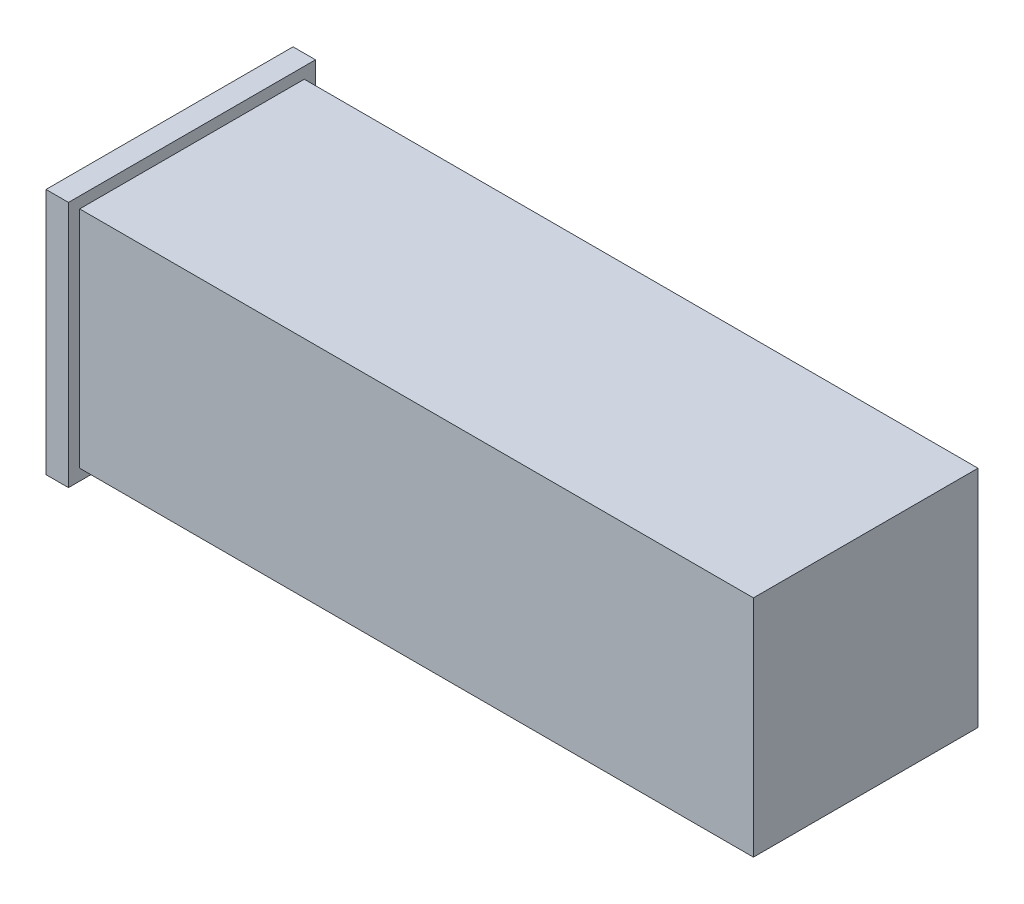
ISO-10303-21;
HEADER;
FILE_DESCRIPTION(('STEP AP214'),'2;1');
FILE_NAME('part.step','',(''),(''),'','','');
FILE_SCHEMA(('AUTOMOTIVE_DESIGN { 1 0 10303 214 1 1 1 1 }'));
ENDSEC;
DATA;
#1=APPLICATION_CONTEXT('core data for automotive mechanical design processes');
#2=APPLICATION_PROTOCOL_DEFINITION('international standard','automotive_design',2000,#1);
#3=PRODUCT_CONTEXT('',#1,'mechanical');
#4=PRODUCT('Part','Part','',(#3));
#5=PRODUCT_RELATED_PRODUCT_CATEGORY('part','',(#4));
#6=PRODUCT_DEFINITION_FORMATION('','',#4);
#7=PRODUCT_DEFINITION_CONTEXT('part definition',#1,'design');
#8=PRODUCT_DEFINITION('design','',#6,#7);
#9=PRODUCT_DEFINITION_SHAPE('','',#8);
#10=(LENGTH_UNIT() NAMED_UNIT(*) SI_UNIT(.MILLI.,.METRE.));
#11=(NAMED_UNIT(*) PLANE_ANGLE_UNIT() SI_UNIT($,.RADIAN.));
#12=(NAMED_UNIT(*) SI_UNIT($,.STERADIAN.) SOLID_ANGLE_UNIT());
#13=UNCERTAINTY_MEASURE_WITH_UNIT(LENGTH_MEASURE(1.E-05),#10,'distance_accuracy_value','');
#14=(GEOMETRIC_REPRESENTATION_CONTEXT(3) GLOBAL_UNCERTAINTY_ASSIGNED_CONTEXT((#13)) GLOBAL_UNIT_ASSIGNED_CONTEXT((#10,
#11,#12)) REPRESENTATION_CONTEXT('',''));
#15=CARTESIAN_POINT('',(0.,0.,0.));
#16=DIRECTION('',(0.,0.,1.));
#17=DIRECTION('',(1.,0.,0.));
#18=AXIS2_PLACEMENT_3D('',#15,#16,#17);
#19=CARTESIAN_POINT('',(0.,-10.9965635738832,100.));
#20=DIRECTION('',(0.,1.,0.));
#21=DIRECTION('',(-1.,0.,0.));
#22=AXIS2_PLACEMENT_3D('',#19,#20,#21);
#23=PLANE('',#22);
#24=DIRECTION('',(1.,0.,0.));
#25=VECTOR('',#24,1.);
#26=CARTESIAN_POINT('',(0.,-10.9965635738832,0.));
#27=LINE('',#26,#25);
#28=CARTESIAN_POINT('',(0.,-10.9965635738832,0.));
#29=VERTEX_POINT('',#28);
#30=CARTESIAN_POINT('',(300.,-10.9965635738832,0.));
#31=VERTEX_POINT('',#30);
#32=EDGE_CURVE('E68',#29,#31,#27,.T.);
#33=ORIENTED_EDGE('',*,*,#32,.T.);
#34=DIRECTION('',(0.,0.,-1.));
#35=VECTOR('',#34,1.);
#36=CARTESIAN_POINT('',(300.,-10.9965635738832,100.));
#37=LINE('',#36,#35);
#38=CARTESIAN_POINT('',(300.,-10.9965635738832,100.));
#39=VERTEX_POINT('',#38);
#40=EDGE_CURVE('E47',#39,#31,#37,.T.);
#41=ORIENTED_EDGE('',*,*,#40,.F.);
#42=DIRECTION('',(1.,0.,0.));
#43=VECTOR('',#42,1.);
#44=CARTESIAN_POINT('',(0.,-10.9965635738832,100.));
#45=LINE('',#44,#43);
#46=CARTESIAN_POINT('',(0.,-10.9965635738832,100.));
#47=VERTEX_POINT('',#46);
#48=EDGE_CURVE('E80',#47,#39,#45,.T.);
#49=ORIENTED_EDGE('',*,*,#48,.F.);
#50=DIRECTION('',(0.,0.,-1.));
#51=VECTOR('',#50,1.);
#52=CARTESIAN_POINT('',(0.,-10.9965635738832,100.));
#53=LINE('',#52,#51);
#54=EDGE_CURVE('E11',#47,#29,#53,.T.);
#55=ORIENTED_EDGE('',*,*,#54,.T.);
#56=EDGE_LOOP('',(#33,#41,#49,#55));
#57=FACE_BOUND('',#56,.T.);
#58=ADVANCED_FACE('F39',(#57),#23,.F.);
#59=CARTESIAN_POINT('',(300.,-10.9965635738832,100.));
#60=DIRECTION('',(-1.,0.,0.));
#61=DIRECTION('',(0.,0.,1.));
#62=AXIS2_PLACEMENT_3D('',#59,#60,#61);
#63=PLANE('',#62);
#64=DIRECTION('',(0.,1.,0.));
#65=VECTOR('',#64,1.);
#66=CARTESIAN_POINT('',(300.,-10.9965635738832,0.));
#67=LINE('',#66,#65);
#68=CARTESIAN_POINT('',(300.,89.0034364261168,0.));
#69=VERTEX_POINT('',#68);
#70=EDGE_CURVE('E75',#31,#69,#67,.T.);
#71=ORIENTED_EDGE('',*,*,#70,.T.);
#72=DIRECTION('',(0.,0.,-1.));
#73=VECTOR('',#72,1.);
#74=CARTESIAN_POINT('',(300.,89.0034364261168,100.));
#75=LINE('',#74,#73);
#76=CARTESIAN_POINT('',(300.,89.0034364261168,100.));
#77=VERTEX_POINT('',#76);
#78=EDGE_CURVE('E157',#77,#69,#75,.T.);
#79=ORIENTED_EDGE('',*,*,#78,.F.);
#80=DIRECTION('',(0.,1.,0.));
#81=VECTOR('',#80,1.);
#82=CARTESIAN_POINT('',(300.,-10.9965635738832,100.));
#83=LINE('',#82,#81);
#84=EDGE_CURVE('E147',#39,#77,#83,.T.);
#85=ORIENTED_EDGE('',*,*,#84,.F.);
#86=ORIENTED_EDGE('',*,*,#40,.T.);
#87=EDGE_LOOP('',(#71,#79,#85,#86));
#88=FACE_BOUND('',#87,.T.);
#89=ADVANCED_FACE('F159',(#88),#63,.F.);
#90=CARTESIAN_POINT('',(0.,89.0034364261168,100.));
#91=DIRECTION('',(0.,-1.,0.));
#92=DIRECTION('',(0.,0.,-1.));
#93=AXIS2_PLACEMENT_3D('',#90,#91,#92);
#94=PLANE('',#93);
#95=DIRECTION('',(-1.,0.,0.));
#96=VECTOR('',#95,1.);
#97=CARTESIAN_POINT('',(0.,89.0034364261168,0.));
#98=LINE('',#97,#96);
#99=CARTESIAN_POINT('',(0.,89.0034364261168,0.));
#100=VERTEX_POINT('',#99);
#101=EDGE_CURVE('E145',#69,#100,#98,.T.);
#102=ORIENTED_EDGE('',*,*,#101,.T.);
#103=DIRECTION('',(0.,0.,-1.));
#104=VECTOR('',#103,1.);
#105=CARTESIAN_POINT('',(0.,89.0034364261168,100.));
#106=LINE('',#105,#104);
#107=CARTESIAN_POINT('',(0.,89.0034364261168,100.));
#108=VERTEX_POINT('',#107);
#109=EDGE_CURVE('E149',#108,#100,#106,.T.);
#110=ORIENTED_EDGE('',*,*,#109,.F.);
#111=DIRECTION('',(-1.,0.,0.));
#112=VECTOR('',#111,1.);
#113=CARTESIAN_POINT('',(0.,89.0034364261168,100.));
#114=LINE('',#113,#112);
#115=EDGE_CURVE('E55',#77,#108,#114,.T.);
#116=ORIENTED_EDGE('',*,*,#115,.F.);
#117=ORIENTED_EDGE('',*,*,#78,.T.);
#118=EDGE_LOOP('',(#102,#110,#116,#117));
#119=FACE_BOUND('',#118,.T.);
#120=ADVANCED_FACE('F164',(#119),#94,.F.);
#121=CARTESIAN_POINT('',(0.,0.,100.));
#122=DIRECTION('',(0.,0.,-1.));
#123=DIRECTION('',(-1.,0.,0.));
#124=AXIS2_PLACEMENT_3D('',#121,#122,#123);
#125=PLANE('',#124);
#126=DIRECTION('',(0.,-1.,0.));
#127=VECTOR('',#126,1.);
#128=CARTESIAN_POINT('',(0.,-10.9965635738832,100.));
#129=LINE('',#128,#127);
#130=EDGE_CURVE('E143',#108,#47,#129,.T.);
#131=ORIENTED_EDGE('',*,*,#130,.T.);
#132=ORIENTED_EDGE('',*,*,#48,.T.);
#133=ORIENTED_EDGE('',*,*,#84,.T.);
#134=ORIENTED_EDGE('',*,*,#115,.T.);
#135=EDGE_LOOP('',(#131,#132,#133,#134));
#136=FACE_BOUND('',#135,.T.);
#137=ADVANCED_FACE('F170',(#136),#125,.F.);
#138=CARTESIAN_POINT('',(0.,0.,0.));
#139=DIRECTION('',(0.,0.,-1.));
#140=DIRECTION('',(-1.,0.,0.));
#141=AXIS2_PLACEMENT_3D('',#138,#139,#140);
#142=PLANE('',#141);
#143=DIRECTION('',(0.,-1.,0.));
#144=VECTOR('',#143,1.);
#145=CARTESIAN_POINT('',(0.,-10.9965635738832,0.));
#146=LINE('',#145,#144);
#147=EDGE_CURVE('E135',#100,#29,#146,.T.);
#148=ORIENTED_EDGE('',*,*,#147,.F.);
#149=ORIENTED_EDGE('',*,*,#101,.F.);
#150=ORIENTED_EDGE('',*,*,#70,.F.);
#151=ORIENTED_EDGE('',*,*,#32,.F.);
#152=EDGE_LOOP('',(#148,#149,#150,#151));
#153=FACE_BOUND('',#152,.T.);
#154=ADVANCED_FACE('F162',(#153),#142,.T.);
#155=CARTESIAN_POINT('',(-10.,-15.9965635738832,105.));
#156=DIRECTION('',(0.,0.,-1.));
#157=DIRECTION('',(-1.,0.,0.));
#158=AXIS2_PLACEMENT_3D('',#155,#156,#157);
#159=PLANE('',#158);
#160=DIRECTION('',(0.,1.,0.));
#161=VECTOR('',#160,1.);
#162=CARTESIAN_POINT('',(0.,-15.9965635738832,105.));
#163=LINE('',#162,#161);
#164=CARTESIAN_POINT('',(0.,-15.9965635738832,105.));
#165=VERTEX_POINT('',#164);
#166=CARTESIAN_POINT('',(0.,94.0034364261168,105.));
#167=VERTEX_POINT('',#166);
#168=EDGE_CURVE('E134',#165,#167,#163,.T.);
#169=ORIENTED_EDGE('',*,*,#168,.T.);
#170=DIRECTION('',(1.,0.,0.));
#171=VECTOR('',#170,1.);
#172=CARTESIAN_POINT('',(-10.,94.0034364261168,105.));
#173=LINE('',#172,#171);
#174=CARTESIAN_POINT('',(-10.,94.0034364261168,105.));
#175=VERTEX_POINT('',#174);
#176=EDGE_CURVE('E114',#175,#167,#173,.T.);
#177=ORIENTED_EDGE('',*,*,#176,.F.);
#178=DIRECTION('',(0.,1.,0.));
#179=VECTOR('',#178,1.);
#180=CARTESIAN_POINT('',(-10.,-15.9965635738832,105.));
#181=LINE('',#180,#179);
#182=CARTESIAN_POINT('',(-10.,-15.9965635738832,105.));
#183=VERTEX_POINT('',#182);
#184=EDGE_CURVE('E121',#183,#175,#181,.T.);
#185=ORIENTED_EDGE('',*,*,#184,.F.);
#186=DIRECTION('',(1.,0.,0.));
#187=VECTOR('',#186,1.);
#188=CARTESIAN_POINT('',(-10.,-15.9965635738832,105.));
#189=LINE('',#188,#187);
#190=EDGE_CURVE('E262',#183,#165,#189,.T.);
#191=ORIENTED_EDGE('',*,*,#190,.T.);
#192=EDGE_LOOP('',(#169,#177,#185,#191));
#193=FACE_BOUND('',#192,.T.);
#194=ADVANCED_FACE('F132',(#193),#159,.F.);
#195=CARTESIAN_POINT('',(-10.,94.0034364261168,-5.));
#196=DIRECTION('',(0.,-1.,0.));
#197=DIRECTION('',(0.,0.,-1.));
#198=AXIS2_PLACEMENT_3D('',#195,#196,#197);
#199=PLANE('',#198);
#200=DIRECTION('',(0.,0.,-1.));
#201=VECTOR('',#200,1.);
#202=CARTESIAN_POINT('',(0.,94.0034364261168,-5.));
#203=LINE('',#202,#201);
#204=CARTESIAN_POINT('',(0.,94.0034364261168,-5.));
#205=VERTEX_POINT('',#204);
#206=EDGE_CURVE('E268',#167,#205,#203,.T.);
#207=ORIENTED_EDGE('',*,*,#206,.T.);
#208=DIRECTION('',(1.,0.,0.));
#209=VECTOR('',#208,1.);
#210=CARTESIAN_POINT('',(-10.,94.0034364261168,-5.));
#211=LINE('',#210,#209);
#212=CARTESIAN_POINT('',(-10.,94.0034364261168,-5.));
#213=VERTEX_POINT('',#212);
#214=EDGE_CURVE('E117',#213,#205,#211,.T.);
#215=ORIENTED_EDGE('',*,*,#214,.F.);
#216=DIRECTION('',(0.,0.,-1.));
#217=VECTOR('',#216,1.);
#218=CARTESIAN_POINT('',(-10.,94.0034364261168,-5.));
#219=LINE('',#218,#217);
#220=EDGE_CURVE('E110',#175,#213,#219,.T.);
#221=ORIENTED_EDGE('',*,*,#220,.F.);
#222=ORIENTED_EDGE('',*,*,#176,.T.);
#223=EDGE_LOOP('',(#207,#215,#221,#222));
#224=FACE_BOUND('',#223,.T.);
#225=ADVANCED_FACE('F112',(#224),#199,.F.);
#226=CARTESIAN_POINT('',(-10.,-15.9965635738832,-4.99999999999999));
#227=DIRECTION('',(0.,0.,1.));
#228=DIRECTION('',(0.,-1.,0.));
#229=AXIS2_PLACEMENT_3D('',#226,#227,#228);
#230=PLANE('',#229);
#231=DIRECTION('',(0.,-1.,0.));
#232=VECTOR('',#231,1.);
#233=CARTESIAN_POINT('',(0.,-15.9965635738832,-4.99999999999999));
#234=LINE('',#233,#232);
#235=CARTESIAN_POINT('',(0.,-15.9965635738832,-4.99999999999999));
#236=VERTEX_POINT('',#235);
#237=EDGE_CURVE('E265',#205,#236,#234,.T.);
#238=ORIENTED_EDGE('',*,*,#237,.T.);
#239=DIRECTION('',(1.,0.,0.));
#240=VECTOR('',#239,1.);
#241=CARTESIAN_POINT('',(-10.,-15.9965635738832,-4.99999999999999));
#242=LINE('',#241,#240);
#243=CARTESIAN_POINT('',(-10.,-15.9965635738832,-4.99999999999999));
#244=VERTEX_POINT('',#243);
#245=EDGE_CURVE('E139',#244,#236,#242,.T.);
#246=ORIENTED_EDGE('',*,*,#245,.F.);
#247=DIRECTION('',(0.,-1.,0.));
#248=VECTOR('',#247,1.);
#249=CARTESIAN_POINT('',(-10.,-15.9965635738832,-4.99999999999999));
#250=LINE('',#249,#248);
#251=EDGE_CURVE('E120',#213,#244,#250,.T.);
#252=ORIENTED_EDGE('',*,*,#251,.F.);
#253=ORIENTED_EDGE('',*,*,#214,.T.);
#254=EDGE_LOOP('',(#238,#246,#252,#253));
#255=FACE_BOUND('',#254,.T.);
#256=ADVANCED_FACE('F222',(#255),#230,.F.);
#257=CARTESIAN_POINT('',(-10.,-15.9965635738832,-4.99999999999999));
#258=DIRECTION('',(0.,1.,0.));
#259=DIRECTION('',(0.,0.,1.));
#260=AXIS2_PLACEMENT_3D('',#257,#258,#259);
#261=PLANE('',#260);
#262=DIRECTION('',(0.,0.,1.));
#263=VECTOR('',#262,1.);
#264=CARTESIAN_POINT('',(0.,-15.9965635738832,-4.99999999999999));
#265=LINE('',#264,#263);
#266=EDGE_CURVE('E130',#236,#165,#265,.T.);
#267=ORIENTED_EDGE('',*,*,#266,.T.);
#268=ORIENTED_EDGE('',*,*,#190,.F.);
#269=DIRECTION('',(0.,0.,1.));
#270=VECTOR('',#269,1.);
#271=CARTESIAN_POINT('',(-10.,-15.9965635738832,-4.99999999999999));
#272=LINE('',#271,#270);
#273=EDGE_CURVE('E126',#244,#183,#272,.T.);
#274=ORIENTED_EDGE('',*,*,#273,.F.);
#275=ORIENTED_EDGE('',*,*,#245,.T.);
#276=EDGE_LOOP('',(#267,#268,#274,#275));
#277=FACE_BOUND('',#276,.T.);
#278=ADVANCED_FACE('F231',(#277),#261,.F.);
#279=CARTESIAN_POINT('',(-10.,0.,0.));
#280=DIRECTION('',(1.,0.,0.));
#281=DIRECTION('',(0.,0.,-1.));
#282=AXIS2_PLACEMENT_3D('',#279,#280,#281);
#283=PLANE('',#282);
#284=ORIENTED_EDGE('',*,*,#184,.T.);
#285=ORIENTED_EDGE('',*,*,#220,.T.);
#286=ORIENTED_EDGE('',*,*,#251,.T.);
#287=ORIENTED_EDGE('',*,*,#273,.T.);
#288=EDGE_LOOP('',(#284,#285,#286,#287));
#289=FACE_BOUND('',#288,.T.);
#290=ADVANCED_FACE('F124',(#289),#283,.F.);
#291=CARTESIAN_POINT('',(0.,0.,0.));
#292=DIRECTION('',(1.,0.,0.));
#293=DIRECTION('',(0.,0.,-1.));
#294=AXIS2_PLACEMENT_3D('',#291,#292,#293);
#295=PLANE('',#294);
#296=ORIENTED_EDGE('',*,*,#109,.T.);
#297=ORIENTED_EDGE('',*,*,#147,.T.);
#298=ORIENTED_EDGE('',*,*,#54,.F.);
#299=ORIENTED_EDGE('',*,*,#130,.F.);
#300=EDGE_LOOP('',(#296,#297,#298,#299));
#301=FACE_BOUND('',#300,.T.);
#302=ORIENTED_EDGE('',*,*,#168,.F.);
#303=ORIENTED_EDGE('',*,*,#266,.F.);
#304=ORIENTED_EDGE('',*,*,#237,.F.);
#305=ORIENTED_EDGE('',*,*,#206,.F.);
#306=EDGE_LOOP('',(#302,#303,#304,#305));
#307=FACE_BOUND('',#306,.T.);
#308=ADVANCED_FACE('F167',(#301,#307),#295,.T.);
#309=CLOSED_SHELL('',(#58,#89,#120,#137,#154,#194,#225,#256,#278,#290,#308));
#310=MANIFOLD_SOLID_BREP('B2',#309);
#311=ADVANCED_BREP_SHAPE_REPRESENTATION('',(#18,#310),#14);
#312=SHAPE_DEFINITION_REPRESENTATION(#9,#311);
ENDSEC;
END-ISO-10303-21;
